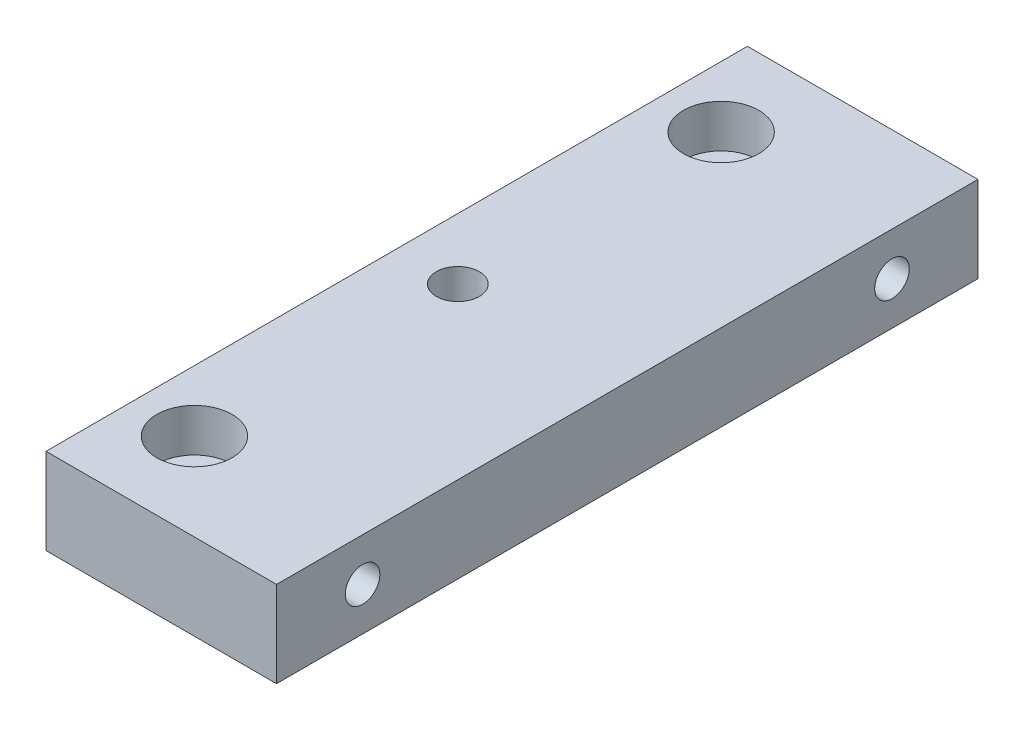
ISO-10303-21;
HEADER;
FILE_DESCRIPTION(('STEP AP214'),'2;1');
FILE_NAME('part.step','',(''),(''),'','','');
FILE_SCHEMA(('AUTOMOTIVE_DESIGN { 1 0 10303 214 1 1 1 1 }'));
ENDSEC;
DATA;
#1=APPLICATION_CONTEXT('core data for automotive mechanical design processes');
#2=APPLICATION_PROTOCOL_DEFINITION('international standard','automotive_design',2000,#1);
#3=PRODUCT_CONTEXT('',#1,'mechanical');
#4=PRODUCT('Part','Part','',(#3));
#5=PRODUCT_RELATED_PRODUCT_CATEGORY('part','',(#4));
#6=PRODUCT_DEFINITION_FORMATION('','',#4);
#7=PRODUCT_DEFINITION_CONTEXT('part definition',#1,'design');
#8=PRODUCT_DEFINITION('design','',#6,#7);
#9=PRODUCT_DEFINITION_SHAPE('','',#8);
#10=(LENGTH_UNIT() NAMED_UNIT(*) SI_UNIT(.MILLI.,.METRE.));
#11=(NAMED_UNIT(*) PLANE_ANGLE_UNIT() SI_UNIT($,.RADIAN.));
#12=(NAMED_UNIT(*) SI_UNIT($,.STERADIAN.) SOLID_ANGLE_UNIT());
#13=UNCERTAINTY_MEASURE_WITH_UNIT(LENGTH_MEASURE(1.E-05),#10,'distance_accuracy_value','');
#14=(GEOMETRIC_REPRESENTATION_CONTEXT(3) GLOBAL_UNCERTAINTY_ASSIGNED_CONTEXT((#13)) GLOBAL_UNIT_ASSIGNED_CONTEXT((#10,
#11,#12)) REPRESENTATION_CONTEXT('',''));
#15=CARTESIAN_POINT('',(0.,0.,0.));
#16=DIRECTION('',(0.,0.,1.));
#17=DIRECTION('',(1.,0.,0.));
#18=AXIS2_PLACEMENT_3D('',#15,#16,#17);
#19=CARTESIAN_POINT('',(17.021175,6.35,-51.7906));
#20=DIRECTION('',(-1.,0.,0.));
#21=DIRECTION('',(0.,0.,1.));
#22=AXIS2_PLACEMENT_3D('',#19,#20,#21);
#23=PLANE('',#22);
#24=CARTESIAN_POINT('',(17.021175,0.,-39.0906));
#25=DIRECTION('',(1.,0.,0.));
#26=DIRECTION('',(0.,0.,-1.));
#27=AXIS2_PLACEMENT_3D('',#24,#25,#26);
#28=CIRCLE('',#27,2.55269999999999);
#29=CARTESIAN_POINT('',(17.021175,0.,-41.6433));
#30=VERTEX_POINT('',#29);
#31=EDGE_CURVE('E104',#30,#30,#28,.T.);
#32=ORIENTED_EDGE('',*,*,#31,.F.);
#33=EDGE_LOOP('',(#32));
#34=FACE_BOUND('',#33,.T.);
#35=CARTESIAN_POINT('',(17.021175,0.,39.0906));
#36=DIRECTION('',(1.,0.,0.));
#37=DIRECTION('',(0.,0.,-1.));
#38=AXIS2_PLACEMENT_3D('',#35,#36,#37);
#39=CIRCLE('',#38,2.55269999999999);
#40=CARTESIAN_POINT('',(17.021175,0.,36.5379));
#41=VERTEX_POINT('',#40);
#42=EDGE_CURVE('E103',#41,#41,#39,.T.);
#43=ORIENTED_EDGE('',*,*,#42,.F.);
#44=EDGE_LOOP('',(#43));
#45=FACE_BOUND('',#44,.T.);
#46=DIRECTION('',(0.,0.,-1.));
#47=VECTOR('',#46,1.);
#48=CARTESIAN_POINT('',(17.021175,-6.35,-51.7906));
#49=LINE('',#48,#47);
#50=CARTESIAN_POINT('',(17.021175,-6.35,51.7906));
#51=VERTEX_POINT('',#50);
#52=CARTESIAN_POINT('',(17.021175,-6.35,-51.7906));
#53=VERTEX_POINT('',#52);
#54=EDGE_CURVE('E144',#51,#53,#49,.T.);
#55=ORIENTED_EDGE('',*,*,#54,.T.);
#56=DIRECTION('',(0.,-1.,0.));
#57=VECTOR('',#56,1.);
#58=CARTESIAN_POINT('',(17.021175,6.35,-51.7906));
#59=LINE('',#58,#57);
#60=CARTESIAN_POINT('',(17.021175,6.35,-51.7906));
#61=VERTEX_POINT('',#60);
#62=EDGE_CURVE('E11',#61,#53,#59,.T.);
#63=ORIENTED_EDGE('',*,*,#62,.F.);
#64=DIRECTION('',(0.,0.,-1.));
#65=VECTOR('',#64,1.);
#66=CARTESIAN_POINT('',(17.021175,6.35,-51.7906));
#67=LINE('',#66,#65);
#68=CARTESIAN_POINT('',(17.021175,6.35,51.7906));
#69=VERTEX_POINT('',#68);
#70=EDGE_CURVE('E145',#69,#61,#67,.T.);
#71=ORIENTED_EDGE('',*,*,#70,.F.);
#72=DIRECTION('',(0.,-1.,0.));
#73=VECTOR('',#72,1.);
#74=CARTESIAN_POINT('',(17.021175,6.35,51.7906));
#75=LINE('',#74,#73);
#76=EDGE_CURVE('E151',#69,#51,#75,.T.);
#77=ORIENTED_EDGE('',*,*,#76,.T.);
#78=EDGE_LOOP('',(#55,#63,#71,#77));
#79=FACE_BOUND('',#78,.T.);
#80=ADVANCED_FACE('F39',(#34,#45,#79),#23,.F.);
#81=CARTESIAN_POINT('',(-17.021175,6.35,-51.7906));
#82=DIRECTION('',(0.,0.,1.));
#83=DIRECTION('',(1.,0.,0.));
#84=AXIS2_PLACEMENT_3D('',#81,#82,#83);
#85=PLANE('',#84);
#86=DIRECTION('',(-1.,0.,0.));
#87=VECTOR('',#86,1.);
#88=CARTESIAN_POINT('',(-17.021175,-6.35,-51.7906));
#89=LINE('',#88,#87);
#90=CARTESIAN_POINT('',(-17.021175,-6.35,-51.7906));
#91=VERTEX_POINT('',#90);
#92=EDGE_CURVE('E154',#53,#91,#89,.T.);
#93=ORIENTED_EDGE('',*,*,#92,.T.);
#94=DIRECTION('',(0.,-1.,0.));
#95=VECTOR('',#94,1.);
#96=CARTESIAN_POINT('',(-17.021175,6.35,-51.7906));
#97=LINE('',#96,#95);
#98=CARTESIAN_POINT('',(-17.021175,6.35,-51.7906));
#99=VERTEX_POINT('',#98);
#100=EDGE_CURVE('E47',#99,#91,#97,.T.);
#101=ORIENTED_EDGE('',*,*,#100,.F.);
#102=DIRECTION('',(-1.,0.,0.));
#103=VECTOR('',#102,1.);
#104=CARTESIAN_POINT('',(-17.021175,6.35,-51.7906));
#105=LINE('',#104,#103);
#106=EDGE_CURVE('E86',#61,#99,#105,.T.);
#107=ORIENTED_EDGE('',*,*,#106,.F.);
#108=ORIENTED_EDGE('',*,*,#62,.T.);
#109=EDGE_LOOP('',(#93,#101,#107,#108));
#110=FACE_BOUND('',#109,.T.);
#111=ADVANCED_FACE('F178',(#110),#85,.F.);
#112=CARTESIAN_POINT('',(-17.021175,6.35,-51.7906));
#113=DIRECTION('',(1.,0.,0.));
#114=DIRECTION('',(0.,0.,-1.));
#115=AXIS2_PLACEMENT_3D('',#112,#113,#114);
#116=PLANE('',#115);
#117=DIRECTION('',(0.,0.,1.));
#118=VECTOR('',#117,1.);
#119=CARTESIAN_POINT('',(-17.021175,-6.35,-51.7906));
#120=LINE('',#119,#118);
#121=CARTESIAN_POINT('',(-17.021175,-6.35,51.7906));
#122=VERTEX_POINT('',#121);
#123=EDGE_CURVE('E73',#91,#122,#120,.T.);
#124=ORIENTED_EDGE('',*,*,#123,.T.);
#125=DIRECTION('',(0.,-1.,0.));
#126=VECTOR('',#125,1.);
#127=CARTESIAN_POINT('',(-17.021175,6.35,51.7906));
#128=LINE('',#127,#126);
#129=CARTESIAN_POINT('',(-17.021175,6.35,51.7906));
#130=VERTEX_POINT('',#129);
#131=EDGE_CURVE('E159',#130,#122,#128,.T.);
#132=ORIENTED_EDGE('',*,*,#131,.F.);
#133=DIRECTION('',(0.,0.,1.));
#134=VECTOR('',#133,1.);
#135=CARTESIAN_POINT('',(-17.021175,6.35,-51.7906));
#136=LINE('',#135,#134);
#137=EDGE_CURVE('E148',#99,#130,#136,.T.);
#138=ORIENTED_EDGE('',*,*,#137,.F.);
#139=ORIENTED_EDGE('',*,*,#100,.T.);
#140=EDGE_LOOP('',(#124,#132,#138,#139));
#141=FACE_BOUND('',#140,.T.);
#142=ADVANCED_FACE('F161',(#141),#116,.F.);
#143=CARTESIAN_POINT('',(-17.021175,6.35,51.7906));
#144=DIRECTION('',(0.,0.,-1.));
#145=DIRECTION('',(-1.,0.,0.));
#146=AXIS2_PLACEMENT_3D('',#143,#144,#145);
#147=PLANE('',#146);
#148=DIRECTION('',(1.,0.,0.));
#149=VECTOR('',#148,1.);
#150=CARTESIAN_POINT('',(-17.021175,-6.35,51.7906));
#151=LINE('',#150,#149);
#152=EDGE_CURVE('E79',#122,#51,#151,.T.);
#153=ORIENTED_EDGE('',*,*,#152,.T.);
#154=ORIENTED_EDGE('',*,*,#76,.F.);
#155=DIRECTION('',(1.,0.,0.));
#156=VECTOR('',#155,1.);
#157=CARTESIAN_POINT('',(-17.021175,6.35,51.7906));
#158=LINE('',#157,#156);
#159=EDGE_CURVE('E55',#130,#69,#158,.T.);
#160=ORIENTED_EDGE('',*,*,#159,.F.);
#161=ORIENTED_EDGE('',*,*,#131,.T.);
#162=EDGE_LOOP('',(#153,#154,#160,#161));
#163=FACE_BOUND('',#162,.T.);
#164=ADVANCED_FACE('F168',(#163),#147,.F.);
#165=CARTESIAN_POINT('',(0.,6.35,0.));
#166=DIRECTION('',(0.,1.,0.));
#167=DIRECTION('',(0.,0.,1.));
#168=AXIS2_PLACEMENT_3D('',#165,#166,#167);
#169=PLANE('',#168);
#170=CARTESIAN_POINT('',(-8.00417499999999,6.35,1.30971622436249E-13));
#171=DIRECTION('',(0.,-1.,0.));
#172=DIRECTION('',(0.,0.,-1.));
#173=AXIS2_PLACEMENT_3D('',#170,#171,#172);
#174=CIRCLE('',#173,3.175);
#175=CARTESIAN_POINT('',(-8.00417499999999,6.35,-3.17499999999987));
#176=VERTEX_POINT('',#175);
#177=EDGE_CURVE('E117',#176,#176,#174,.T.);
#178=ORIENTED_EDGE('',*,*,#177,.T.);
#179=EDGE_LOOP('',(#178));
#180=FACE_BOUND('',#179,.T.);
#181=CARTESIAN_POINT('',(-8.00417500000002,6.35,38.8874000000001));
#182=DIRECTION('',(0.,1.,0.));
#183=DIRECTION('',(0.,0.,1.));
#184=AXIS2_PLACEMENT_3D('',#181,#182,#183);
#185=CIRCLE('',#184,5.55625);
#186=CARTESIAN_POINT('',(-8.00417500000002,6.35,44.4436500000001));
#187=VERTEX_POINT('',#186);
#188=EDGE_CURVE('E120',#187,#187,#185,.T.);
#189=ORIENTED_EDGE('',*,*,#188,.F.);
#190=EDGE_LOOP('',(#189));
#191=FACE_BOUND('',#190,.T.);
#192=CARTESIAN_POINT('',(-8.00417499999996,6.35,-38.8873999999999));
#193=DIRECTION('',(0.,1.,0.));
#194=DIRECTION('',(0.,0.,1.));
#195=AXIS2_PLACEMENT_3D('',#192,#193,#194);
#196=CIRCLE('',#195,5.55625);
#197=CARTESIAN_POINT('',(-8.00417499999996,6.35,-33.3311499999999));
#198=VERTEX_POINT('',#197);
#199=EDGE_CURVE('E132',#198,#198,#196,.T.);
#200=ORIENTED_EDGE('',*,*,#199,.F.);
#201=EDGE_LOOP('',(#200));
#202=FACE_BOUND('',#201,.T.);
#203=ORIENTED_EDGE('',*,*,#70,.T.);
#204=ORIENTED_EDGE('',*,*,#106,.T.);
#205=ORIENTED_EDGE('',*,*,#137,.T.);
#206=ORIENTED_EDGE('',*,*,#159,.T.);
#207=EDGE_LOOP('',(#203,#204,#205,#206));
#208=FACE_BOUND('',#207,.T.);
#209=ADVANCED_FACE('F170',(#180,#191,#202,#208),#169,.T.);
#210=CARTESIAN_POINT('',(0.,-6.35,0.));
#211=DIRECTION('',(0.,1.,0.));
#212=DIRECTION('',(0.,0.,1.));
#213=AXIS2_PLACEMENT_3D('',#210,#211,#212);
#214=PLANE('',#213);
#215=CARTESIAN_POINT('',(-8.00417499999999,-6.35,1.30971622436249E-13));
#216=DIRECTION('',(0.,-1.,0.));
#217=DIRECTION('',(0.,0.,-1.));
#218=AXIS2_PLACEMENT_3D('',#215,#216,#217);
#219=CIRCLE('',#218,3.175);
#220=CARTESIAN_POINT('',(-8.00417499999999,-6.35,-3.17499999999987));
#221=VERTEX_POINT('',#220);
#222=EDGE_CURVE('E114',#221,#221,#219,.T.);
#223=ORIENTED_EDGE('',*,*,#222,.F.);
#224=EDGE_LOOP('',(#223));
#225=FACE_BOUND('',#224,.T.);
#226=CARTESIAN_POINT('',(-8.00417500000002,-6.35,38.8874000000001));
#227=DIRECTION('',(0.,1.,0.));
#228=DIRECTION('',(0.,0.,1.));
#229=AXIS2_PLACEMENT_3D('',#226,#227,#228);
#230=CIRCLE('',#229,3.3782);
#231=CARTESIAN_POINT('',(-8.00417500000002,-6.35,42.2656000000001));
#232=VERTEX_POINT('',#231);
#233=EDGE_CURVE('E129',#232,#232,#230,.T.);
#234=ORIENTED_EDGE('',*,*,#233,.T.);
#235=EDGE_LOOP('',(#234));
#236=FACE_BOUND('',#235,.T.);
#237=CARTESIAN_POINT('',(-8.00417499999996,-6.35,-38.8873999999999));
#238=DIRECTION('',(0.,1.,0.));
#239=DIRECTION('',(0.,0.,1.));
#240=AXIS2_PLACEMENT_3D('',#237,#238,#239);
#241=CIRCLE('',#240,3.3782);
#242=CARTESIAN_POINT('',(-8.00417499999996,-6.35,-35.5091999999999));
#243=VERTEX_POINT('',#242);
#244=EDGE_CURVE('E141',#243,#243,#241,.T.);
#245=ORIENTED_EDGE('',*,*,#244,.T.);
#246=EDGE_LOOP('',(#245));
#247=FACE_BOUND('',#246,.T.);
#248=ORIENTED_EDGE('',*,*,#54,.F.);
#249=ORIENTED_EDGE('',*,*,#152,.F.);
#250=ORIENTED_EDGE('',*,*,#123,.F.);
#251=ORIENTED_EDGE('',*,*,#92,.F.);
#252=EDGE_LOOP('',(#248,#249,#250,#251));
#253=FACE_BOUND('',#252,.T.);
#254=ADVANCED_FACE('F164',(#225,#236,#247,#253),#214,.F.);
#255=CARTESIAN_POINT('',(-8.00417499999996,6.35,-38.8873999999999));
#256=DIRECTION('',(0.,1.,0.));
#257=DIRECTION('',(0.,0.,1.));
#258=AXIS2_PLACEMENT_3D('',#255,#256,#257);
#259=CYLINDRICAL_SURFACE('',#258,3.3782);
#260=ORIENTED_EDGE('',*,*,#244,.F.);
#261=EDGE_LOOP('',(#260));
#262=FACE_BOUND('',#261,.T.);
#263=CARTESIAN_POINT('',(-8.00417499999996,0.,-38.8873999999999));
#264=DIRECTION('',(0.,1.,0.));
#265=DIRECTION('',(0.,0.,1.));
#266=AXIS2_PLACEMENT_3D('',#263,#264,#265);
#267=CIRCLE('',#266,3.3782);
#268=CARTESIAN_POINT('',(-8.00417499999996,0.,-35.5091999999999));
#269=VERTEX_POINT('',#268);
#270=EDGE_CURVE('E138',#269,#269,#267,.T.);
#271=ORIENTED_EDGE('',*,*,#270,.T.);
#272=EDGE_LOOP('',(#271));
#273=FACE_BOUND('',#272,.T.);
#274=ADVANCED_FACE('F225',(#262,#273),#259,.F.);
#275=CARTESIAN_POINT('',(-4.62597499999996,0.,-38.8873999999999));
#276=DIRECTION('',(0.,-1.,0.));
#277=DIRECTION('',(0.,0.,-1.));
#278=AXIS2_PLACEMENT_3D('',#275,#276,#277);
#279=PLANE('',#278);
#280=ORIENTED_EDGE('',*,*,#270,.F.);
#281=EDGE_LOOP('',(#280));
#282=FACE_BOUND('',#281,.T.);
#283=CARTESIAN_POINT('',(-8.00417499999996,0.,-38.8873999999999));
#284=DIRECTION('',(0.,1.,0.));
#285=DIRECTION('',(0.,0.,1.));
#286=AXIS2_PLACEMENT_3D('',#283,#284,#285);
#287=CIRCLE('',#286,5.55625);
#288=CARTESIAN_POINT('',(-8.00417499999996,0.,-33.3311499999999));
#289=VERTEX_POINT('',#288);
#290=EDGE_CURVE('E135',#289,#289,#287,.T.);
#291=ORIENTED_EDGE('',*,*,#290,.T.);
#292=EDGE_LOOP('',(#291));
#293=FACE_BOUND('',#292,.T.);
#294=ADVANCED_FACE('F221',(#282,#293),#279,.F.);
#295=CARTESIAN_POINT('',(-8.00417499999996,6.35,-38.8873999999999));
#296=DIRECTION('',(0.,1.,0.));
#297=DIRECTION('',(0.,0.,1.));
#298=AXIS2_PLACEMENT_3D('',#295,#296,#297);
#299=CYLINDRICAL_SURFACE('',#298,5.55625);
#300=ORIENTED_EDGE('',*,*,#290,.F.);
#301=EDGE_LOOP('',(#300));
#302=FACE_BOUND('',#301,.T.);
#303=ORIENTED_EDGE('',*,*,#199,.T.);
#304=EDGE_LOOP('',(#303));
#305=FACE_BOUND('',#304,.T.);
#306=ADVANCED_FACE('F217',(#302,#305),#299,.F.);
#307=CARTESIAN_POINT('',(-8.00417500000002,6.35,38.8874000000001));
#308=DIRECTION('',(0.,1.,0.));
#309=DIRECTION('',(0.,0.,1.));
#310=AXIS2_PLACEMENT_3D('',#307,#308,#309);
#311=CYLINDRICAL_SURFACE('',#310,3.3782);
#312=ORIENTED_EDGE('',*,*,#233,.F.);
#313=EDGE_LOOP('',(#312));
#314=FACE_BOUND('',#313,.T.);
#315=CARTESIAN_POINT('',(-8.00417500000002,0.,38.8874000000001));
#316=DIRECTION('',(0.,1.,0.));
#317=DIRECTION('',(0.,0.,1.));
#318=AXIS2_PLACEMENT_3D('',#315,#316,#317);
#319=CIRCLE('',#318,3.3782);
#320=CARTESIAN_POINT('',(-8.00417500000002,0.,42.2656000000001));
#321=VERTEX_POINT('',#320);
#322=EDGE_CURVE('E126',#321,#321,#319,.T.);
#323=ORIENTED_EDGE('',*,*,#322,.T.);
#324=EDGE_LOOP('',(#323));
#325=FACE_BOUND('',#324,.T.);
#326=ADVANCED_FACE('F213',(#314,#325),#311,.F.);
#327=CARTESIAN_POINT('',(-4.62597500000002,0.,38.8874000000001));
#328=DIRECTION('',(0.,-1.,0.));
#329=DIRECTION('',(0.,0.,-1.));
#330=AXIS2_PLACEMENT_3D('',#327,#328,#329);
#331=PLANE('',#330);
#332=ORIENTED_EDGE('',*,*,#322,.F.);
#333=EDGE_LOOP('',(#332));
#334=FACE_BOUND('',#333,.T.);
#335=CARTESIAN_POINT('',(-8.00417500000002,0.,38.8874000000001));
#336=DIRECTION('',(0.,1.,0.));
#337=DIRECTION('',(0.,0.,1.));
#338=AXIS2_PLACEMENT_3D('',#335,#336,#337);
#339=CIRCLE('',#338,5.55625);
#340=CARTESIAN_POINT('',(-8.00417500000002,0.,44.4436500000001));
#341=VERTEX_POINT('',#340);
#342=EDGE_CURVE('E123',#341,#341,#339,.T.);
#343=ORIENTED_EDGE('',*,*,#342,.T.);
#344=EDGE_LOOP('',(#343));
#345=FACE_BOUND('',#344,.T.);
#346=ADVANCED_FACE('F209',(#334,#345),#331,.F.);
#347=CARTESIAN_POINT('',(-8.00417500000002,6.35,38.8874000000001));
#348=DIRECTION('',(0.,1.,0.));
#349=DIRECTION('',(0.,0.,1.));
#350=AXIS2_PLACEMENT_3D('',#347,#348,#349);
#351=CYLINDRICAL_SURFACE('',#350,5.55625);
#352=ORIENTED_EDGE('',*,*,#342,.F.);
#353=EDGE_LOOP('',(#352));
#354=FACE_BOUND('',#353,.T.);
#355=ORIENTED_EDGE('',*,*,#188,.T.);
#356=EDGE_LOOP('',(#355));
#357=FACE_BOUND('',#356,.T.);
#358=ADVANCED_FACE('F205',(#354,#357),#351,.F.);
#359=CARTESIAN_POINT('',(-8.00417499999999,-6.35,1.30971622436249E-13));
#360=DIRECTION('',(0.,-1.,0.));
#361=DIRECTION('',(0.,0.,-1.));
#362=AXIS2_PLACEMENT_3D('',#359,#360,#361);
#363=CYLINDRICAL_SURFACE('',#362,3.175);
#364=ORIENTED_EDGE('',*,*,#177,.F.);
#365=EDGE_LOOP('',(#364));
#366=FACE_BOUND('',#365,.T.);
#367=ORIENTED_EDGE('',*,*,#222,.T.);
#368=EDGE_LOOP('',(#367));
#369=FACE_BOUND('',#368,.T.);
#370=ADVANCED_FACE('F197',(#366,#369),#363,.F.);
#371=CARTESIAN_POINT('',(0.511175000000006,0.,39.0906));
#372=DIRECTION('',(1.,0.,0.));
#373=DIRECTION('',(0.,0.,-1.));
#374=AXIS2_PLACEMENT_3D('',#371,#372,#373);
#375=CONICAL_SURFACE('',#374,2.55269999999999,1.02974425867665);
#376=CARTESIAN_POINT('',(-1.02264190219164,0.,39.0906));
#377=VERTEX_POINT('',#376);
#378=VERTEX_LOOP('',#377);
#379=FACE_BOUND('',#378,.T.);
#380=CARTESIAN_POINT('',(0.511175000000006,0.,39.0906));
#381=DIRECTION('',(1.,0.,0.));
#382=DIRECTION('',(0.,0.,-1.));
#383=AXIS2_PLACEMENT_3D('',#380,#381,#382);
#384=CIRCLE('',#383,2.55269999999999);
#385=CARTESIAN_POINT('',(0.511175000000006,0.,36.5379));
#386=VERTEX_POINT('',#385);
#387=EDGE_CURVE('E107',#386,#386,#384,.T.);
#388=ORIENTED_EDGE('',*,*,#387,.T.);
#389=EDGE_LOOP('',(#388));
#390=FACE_BOUND('',#389,.T.);
#391=ADVANCED_FACE('F191',(#379,#390),#375,.F.);
#392=CARTESIAN_POINT('',(17.021175,0.,39.0906));
#393=DIRECTION('',(1.,0.,0.));
#394=DIRECTION('',(0.,0.,-1.));
#395=AXIS2_PLACEMENT_3D('',#392,#393,#394);
#396=CYLINDRICAL_SURFACE('',#395,2.55269999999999);
#397=ORIENTED_EDGE('',*,*,#387,.F.);
#398=EDGE_LOOP('',(#397));
#399=FACE_BOUND('',#398,.T.);
#400=ORIENTED_EDGE('',*,*,#42,.T.);
#401=EDGE_LOOP('',(#400));
#402=FACE_BOUND('',#401,.T.);
#403=ADVANCED_FACE('F97',(#399,#402),#396,.F.);
#404=CARTESIAN_POINT('',(0.511175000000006,0.,-39.0906));
#405=DIRECTION('',(1.,0.,0.));
#406=DIRECTION('',(0.,0.,-1.));
#407=AXIS2_PLACEMENT_3D('',#404,#405,#406);
#408=CONICAL_SURFACE('',#407,2.55269999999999,1.02974425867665);
#409=CARTESIAN_POINT('',(-1.02264190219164,0.,-39.0906));
#410=VERTEX_POINT('',#409);
#411=VERTEX_LOOP('',#410);
#412=FACE_BOUND('',#411,.T.);
#413=CARTESIAN_POINT('',(0.511175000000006,0.,-39.0906));
#414=DIRECTION('',(1.,0.,0.));
#415=DIRECTION('',(0.,0.,-1.));
#416=AXIS2_PLACEMENT_3D('',#413,#414,#415);
#417=CIRCLE('',#416,2.55269999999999);
#418=CARTESIAN_POINT('',(0.511175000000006,0.,-41.6433));
#419=VERTEX_POINT('',#418);
#420=EDGE_CURVE('E101',#419,#419,#417,.T.);
#421=ORIENTED_EDGE('',*,*,#420,.T.);
#422=EDGE_LOOP('',(#421));
#423=FACE_BOUND('',#422,.T.);
#424=ADVANCED_FACE('F93',(#412,#423),#408,.F.);
#425=CARTESIAN_POINT('',(17.021175,0.,-39.0906));
#426=DIRECTION('',(1.,0.,0.));
#427=DIRECTION('',(0.,0.,-1.));
#428=AXIS2_PLACEMENT_3D('',#425,#426,#427);
#429=CYLINDRICAL_SURFACE('',#428,2.55269999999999);
#430=ORIENTED_EDGE('',*,*,#420,.F.);
#431=EDGE_LOOP('',(#430));
#432=FACE_BOUND('',#431,.T.);
#433=ORIENTED_EDGE('',*,*,#31,.T.);
#434=EDGE_LOOP('',(#433));
#435=FACE_BOUND('',#434,.T.);
#436=ADVANCED_FACE('F96',(#432,#435),#429,.F.);
#437=CLOSED_SHELL('',(#80,#111,#142,#164,#209,#254,#274,#294,#306,#326,#346,#358,#370,#391,#403,
#424,#436));
#438=MANIFOLD_SOLID_BREP('B2',#437);
#439=ADVANCED_BREP_SHAPE_REPRESENTATION('',(#18,#438),#14);
#440=SHAPE_DEFINITION_REPRESENTATION(#9,#439);
ENDSEC;
END-ISO-10303-21;
